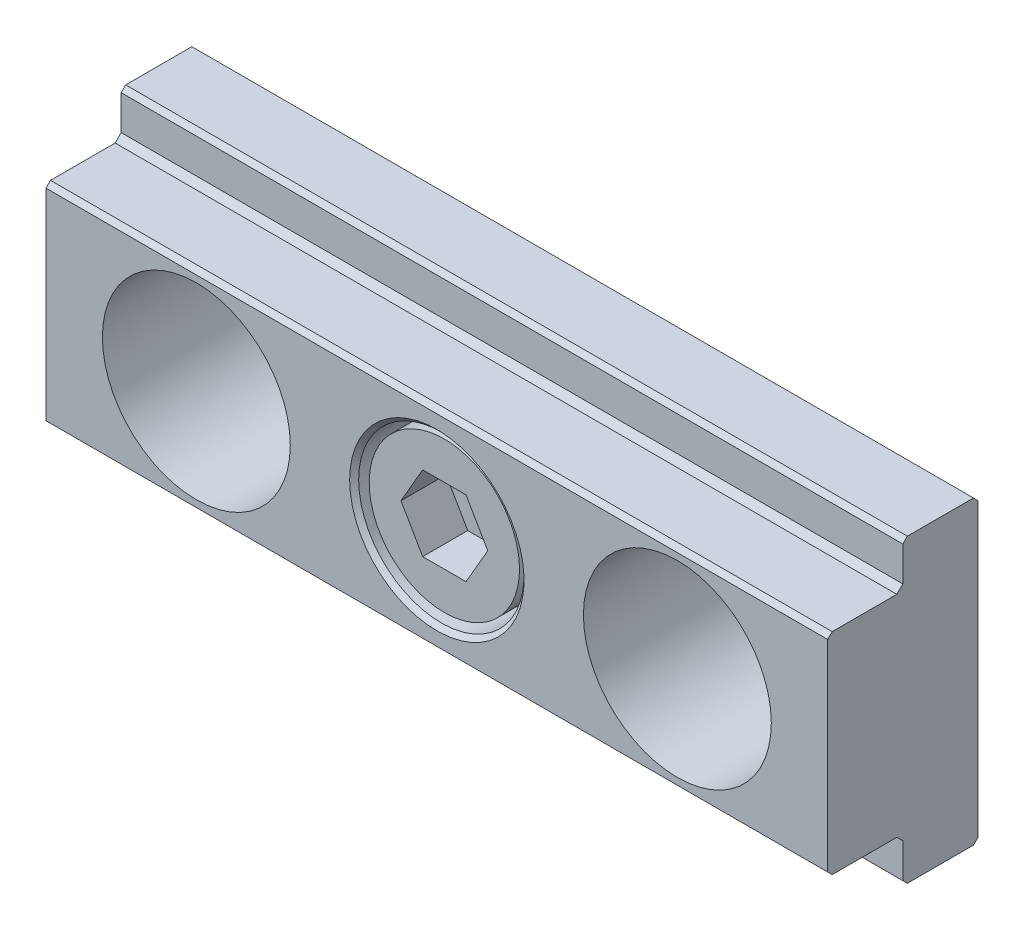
ISO-10303-21;
HEADER;
FILE_DESCRIPTION(('STEP AP214'),'2;1');
FILE_NAME('part.step','',(''),(''),'','','');
FILE_SCHEMA(('AUTOMOTIVE_DESIGN { 1 0 10303 214 1 1 1 1 }'));
ENDSEC;
DATA;
#1=APPLICATION_CONTEXT('core data for automotive mechanical design processes');
#2=APPLICATION_PROTOCOL_DEFINITION('international standard','automotive_design',2000,#1);
#3=PRODUCT_CONTEXT('',#1,'mechanical');
#4=PRODUCT('Part','Part','',(#3));
#5=PRODUCT_RELATED_PRODUCT_CATEGORY('part','',(#4));
#6=PRODUCT_DEFINITION_FORMATION('','',#4);
#7=PRODUCT_DEFINITION_CONTEXT('part definition',#1,'design');
#8=PRODUCT_DEFINITION('design','',#6,#7);
#9=PRODUCT_DEFINITION_SHAPE('','',#8);
#10=(LENGTH_UNIT() NAMED_UNIT(*) SI_UNIT(.MILLI.,.METRE.));
#11=(NAMED_UNIT(*) PLANE_ANGLE_UNIT() SI_UNIT($,.RADIAN.));
#12=(NAMED_UNIT(*) SI_UNIT($,.STERADIAN.) SOLID_ANGLE_UNIT());
#13=UNCERTAINTY_MEASURE_WITH_UNIT(LENGTH_MEASURE(1.E-05),#10,'distance_accuracy_value','');
#14=(GEOMETRIC_REPRESENTATION_CONTEXT(3) GLOBAL_UNCERTAINTY_ASSIGNED_CONTEXT((#13)) GLOBAL_UNIT_ASSIGNED_CONTEXT((#10,
#11,#12)) REPRESENTATION_CONTEXT('',''));
#15=CARTESIAN_POINT('',(0.,0.,0.));
#16=DIRECTION('',(0.,0.,1.));
#17=DIRECTION('',(1.,0.,0.));
#18=AXIS2_PLACEMENT_3D('',#15,#16,#17);
#19=CARTESIAN_POINT('',(0.,-5.5,3.5));
#20=DIRECTION('',(0.,0.,-1.));
#21=DIRECTION('',(1.,0.,0.));
#22=AXIS2_PLACEMENT_3D('',#19,#20,#21);
#23=PLANE('',#22);
#24=CARTESIAN_POINT('',(0.,0.,3.5));
#25=DIRECTION('',(0.,0.,1.));
#26=DIRECTION('',(-1.,0.,0.));
#27=AXIS2_PLACEMENT_3D('',#24,#25,#26);
#28=CIRCLE('',#27,5.5);
#29=CARTESIAN_POINT('',(-5.5,0.,3.5));
#30=VERTEX_POINT('',#29);
#31=EDGE_CURVE('E207',#30,#30,#28,.T.);
#32=ORIENTED_EDGE('',*,*,#31,.T.);
#33=EDGE_LOOP('',(#32));
#34=FACE_BOUND('',#33,.T.);
#35=CARTESIAN_POINT('',(0.,0.,3.5));
#36=DIRECTION('',(0.,0.,1.));
#37=DIRECTION('',(0.,-1.,0.));
#38=AXIS2_PLACEMENT_3D('',#35,#36,#37);
#39=CIRCLE('',#38,5.);
#40=CARTESIAN_POINT('',(0.,-5.,3.5));
#41=VERTEX_POINT('',#40);
#42=EDGE_CURVE('E9',#41,#41,#39,.T.);
#43=ORIENTED_EDGE('',*,*,#42,.F.);
#44=EDGE_LOOP('',(#43));
#45=FACE_BOUND('',#44,.T.);
#46=ADVANCED_FACE('F14',(#34,#45),#23,.F.);
#47=CARTESIAN_POINT('',(-26.,-6.7,10.));
#48=DIRECTION('',(0.,0.70710678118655,-0.707106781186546));
#49=DIRECTION('',(0.,-0.707106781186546,-0.70710678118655));
#50=AXIS2_PLACEMENT_3D('',#47,#48,#49);
#51=PLANE('',#50);
#52=DIRECTION('',(0.,0.707106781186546,0.70710678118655));
#53=VECTOR('',#52,1.);
#54=CARTESIAN_POINT('',(26.,-6.7,10.));
#55=LINE('',#54,#53);
#56=CARTESIAN_POINT('',(26.,-7.,9.7));
#57=VERTEX_POINT('',#56);
#58=CARTESIAN_POINT('',(26.,-6.7,10.));
#59=VERTEX_POINT('',#58);
#60=EDGE_CURVE('E219',#57,#59,#55,.T.);
#61=ORIENTED_EDGE('',*,*,#60,.T.);
#62=DIRECTION('',(1.,0.,0.));
#63=VECTOR('',#62,1.);
#64=CARTESIAN_POINT('',(-26.,-6.7,10.));
#65=LINE('',#64,#63);
#66=CARTESIAN_POINT('',(-26.,-6.7,10.));
#67=VERTEX_POINT('',#66);
#68=EDGE_CURVE('E24',#67,#59,#65,.T.);
#69=ORIENTED_EDGE('',*,*,#68,.F.);
#70=DIRECTION('',(0.,0.707106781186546,0.70710678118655));
#71=VECTOR('',#70,1.);
#72=CARTESIAN_POINT('',(-26.,-6.7,10.));
#73=LINE('',#72,#71);
#74=CARTESIAN_POINT('',(-26.,-7.,9.7));
#75=VERTEX_POINT('',#74);
#76=EDGE_CURVE('E220',#75,#67,#73,.T.);
#77=ORIENTED_EDGE('',*,*,#76,.F.);
#78=DIRECTION('',(1.,0.,0.));
#79=VECTOR('',#78,1.);
#80=CARTESIAN_POINT('',(-26.,-7.,9.7));
#81=LINE('',#80,#79);
#82=EDGE_CURVE('E265',#75,#57,#81,.T.);
#83=ORIENTED_EDGE('',*,*,#82,.T.);
#84=EDGE_LOOP('',(#61,#69,#77,#83));
#85=FACE_BOUND('',#84,.T.);
#86=ADVANCED_FACE('F351',(#85),#51,.F.);
#87=CARTESIAN_POINT('',(-26.,6.7,10.));
#88=DIRECTION('',(0.,0.,-1.));
#89=DIRECTION('',(1.,0.,0.));
#90=AXIS2_PLACEMENT_3D('',#87,#88,#89);
#91=PLANE('',#90);
#92=CARTESIAN_POINT('',(16.,0.,10.));
#93=DIRECTION('',(0.,0.,-1.));
#94=DIRECTION('',(-1.,0.,0.));
#95=AXIS2_PLACEMENT_3D('',#92,#93,#94);
#96=CIRCLE('',#95,6.25);
#97=CARTESIAN_POINT('',(9.75,0.,10.));
#98=VERTEX_POINT('',#97);
#99=EDGE_CURVE('E749',#98,#98,#96,.T.);
#100=ORIENTED_EDGE('',*,*,#99,.T.);
#101=EDGE_LOOP('',(#100));
#102=FACE_BOUND('',#101,.T.);
#103=CARTESIAN_POINT('',(-16.,0.,10.));
#104=DIRECTION('',(0.,0.,1.));
#105=DIRECTION('',(-1.,0.,0.));
#106=AXIS2_PLACEMENT_3D('',#103,#104,#105);
#107=CIRCLE('',#106,6.25);
#108=CARTESIAN_POINT('',(-22.25,0.,10.));
#109=VERTEX_POINT('',#108);
#110=EDGE_CURVE('E189',#109,#109,#107,.T.);
#111=ORIENTED_EDGE('',*,*,#110,.F.);
#112=EDGE_LOOP('',(#111));
#113=FACE_BOUND('',#112,.T.);
#114=CARTESIAN_POINT('',(0.,0.,10.));
#115=DIRECTION('',(0.,0.,1.));
#116=DIRECTION('',(-1.,0.,0.));
#117=AXIS2_PLACEMENT_3D('',#114,#115,#116);
#118=CIRCLE('',#117,5.8);
#119=CARTESIAN_POINT('',(-5.8,0.,10.));
#120=VERTEX_POINT('',#119);
#121=EDGE_CURVE('E198',#120,#120,#118,.T.);
#122=ORIENTED_EDGE('',*,*,#121,.F.);
#123=EDGE_LOOP('',(#122));
#124=FACE_BOUND('',#123,.T.);
#125=DIRECTION('',(0.,1.,0.));
#126=VECTOR('',#125,1.);
#127=CARTESIAN_POINT('',(26.,6.7,10.));
#128=LINE('',#127,#126);
#129=CARTESIAN_POINT('',(26.,6.7,10.));
#130=VERTEX_POINT('',#129);
#131=EDGE_CURVE('E268',#59,#130,#128,.T.);
#132=ORIENTED_EDGE('',*,*,#131,.T.);
#133=DIRECTION('',(1.,0.,0.));
#134=VECTOR('',#133,1.);
#135=CARTESIAN_POINT('',(-26.,6.7,10.));
#136=LINE('',#135,#134);
#137=CARTESIAN_POINT('',(-26.,6.7,10.));
#138=VERTEX_POINT('',#137);
#139=EDGE_CURVE('E337',#138,#130,#136,.T.);
#140=ORIENTED_EDGE('',*,*,#139,.F.);
#141=DIRECTION('',(0.,1.,0.));
#142=VECTOR('',#141,1.);
#143=CARTESIAN_POINT('',(-26.,6.7,10.));
#144=LINE('',#143,#142);
#145=EDGE_CURVE('E222',#67,#138,#144,.T.);
#146=ORIENTED_EDGE('',*,*,#145,.F.);
#147=ORIENTED_EDGE('',*,*,#68,.T.);
#148=EDGE_LOOP('',(#132,#140,#146,#147));
#149=FACE_BOUND('',#148,.T.);
#150=ADVANCED_FACE('F347',(#102,#113,#124,#149),#91,.F.);
#151=CARTESIAN_POINT('',(-26.,7.,9.7));
#152=DIRECTION('',(0.,-0.70710678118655,-0.707106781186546));
#153=DIRECTION('',(0.,-0.707106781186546,0.70710678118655));
#154=AXIS2_PLACEMENT_3D('',#151,#152,#153);
#155=PLANE('',#154);
#156=DIRECTION('',(0.,0.707106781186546,-0.70710678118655));
#157=VECTOR('',#156,1.);
#158=CARTESIAN_POINT('',(26.,7.,9.7));
#159=LINE('',#158,#157);
#160=CARTESIAN_POINT('',(26.,7.,9.7));
#161=VERTEX_POINT('',#160);
#162=EDGE_CURVE('E270',#130,#161,#159,.T.);
#163=ORIENTED_EDGE('',*,*,#162,.T.);
#164=DIRECTION('',(1.,0.,0.));
#165=VECTOR('',#164,1.);
#166=CARTESIAN_POINT('',(-26.,7.,9.7));
#167=LINE('',#166,#165);
#168=CARTESIAN_POINT('',(-26.,7.,9.7));
#169=VERTEX_POINT('',#168);
#170=EDGE_CURVE('E335',#169,#161,#167,.T.);
#171=ORIENTED_EDGE('',*,*,#170,.F.);
#172=DIRECTION('',(0.,0.707106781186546,-0.70710678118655));
#173=VECTOR('',#172,1.);
#174=CARTESIAN_POINT('',(-26.,7.,9.7));
#175=LINE('',#174,#173);
#176=EDGE_CURVE('E226',#138,#169,#175,.T.);
#177=ORIENTED_EDGE('',*,*,#176,.F.);
#178=ORIENTED_EDGE('',*,*,#139,.T.);
#179=EDGE_LOOP('',(#163,#171,#177,#178));
#180=FACE_BOUND('',#179,.T.);
#181=ADVANCED_FACE('F359',(#180),#155,.F.);
#182=CARTESIAN_POINT('',(-26.,7.,5.4));
#183=DIRECTION('',(0.,-1.,0.));
#184=DIRECTION('',(1.,0.,0.));
#185=AXIS2_PLACEMENT_3D('',#182,#183,#184);
#186=PLANE('',#185);
#187=DIRECTION('',(0.,0.,-1.));
#188=VECTOR('',#187,1.);
#189=CARTESIAN_POINT('',(26.,7.,5.4));
#190=LINE('',#189,#188);
#191=CARTESIAN_POINT('',(26.,7.,5.4));
#192=VERTEX_POINT('',#191);
#193=EDGE_CURVE('E272',#161,#192,#190,.T.);
#194=ORIENTED_EDGE('',*,*,#193,.T.);
#195=DIRECTION('',(1.,0.,0.));
#196=VECTOR('',#195,1.);
#197=CARTESIAN_POINT('',(-26.,7.,5.4));
#198=LINE('',#197,#196);
#199=CARTESIAN_POINT('',(-26.,7.,5.4));
#200=VERTEX_POINT('',#199);
#201=EDGE_CURVE('E332',#200,#192,#198,.T.);
#202=ORIENTED_EDGE('',*,*,#201,.F.);
#203=DIRECTION('',(0.,0.,-1.));
#204=VECTOR('',#203,1.);
#205=CARTESIAN_POINT('',(-26.,7.,5.4));
#206=LINE('',#205,#204);
#207=EDGE_CURVE('E229',#169,#200,#206,.T.);
#208=ORIENTED_EDGE('',*,*,#207,.F.);
#209=ORIENTED_EDGE('',*,*,#170,.T.);
#210=EDGE_LOOP('',(#194,#202,#208,#209));
#211=FACE_BOUND('',#210,.T.);
#212=ADVANCED_FACE('F363',(#211),#186,.F.);
#213=CARTESIAN_POINT('',(-26.,7.4,5.));
#214=DIRECTION('',(0.,-0.707106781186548,-0.707106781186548));
#215=DIRECTION('',(0.,-0.707106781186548,0.707106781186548));
#216=AXIS2_PLACEMENT_3D('',#213,#214,#215);
#217=PLANE('',#216);
#218=DIRECTION('',(0.,0.707106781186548,-0.707106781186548));
#219=VECTOR('',#218,1.);
#220=CARTESIAN_POINT('',(26.,7.4,5.));
#221=LINE('',#220,#219);
#222=CARTESIAN_POINT('',(26.,7.4,5.));
#223=VERTEX_POINT('',#222);
#224=EDGE_CURVE('E274',#192,#223,#221,.T.);
#225=ORIENTED_EDGE('',*,*,#224,.T.);
#226=DIRECTION('',(1.,0.,0.));
#227=VECTOR('',#226,1.);
#228=CARTESIAN_POINT('',(-26.,7.4,5.));
#229=LINE('',#228,#227);
#230=CARTESIAN_POINT('',(-26.,7.4,5.));
#231=VERTEX_POINT('',#230);
#232=EDGE_CURVE('E329',#231,#223,#229,.T.);
#233=ORIENTED_EDGE('',*,*,#232,.F.);
#234=DIRECTION('',(0.,0.707106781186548,-0.707106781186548));
#235=VECTOR('',#234,1.);
#236=CARTESIAN_POINT('',(-26.,7.4,5.));
#237=LINE('',#236,#235);
#238=EDGE_CURVE('E232',#200,#231,#237,.T.);
#239=ORIENTED_EDGE('',*,*,#238,.F.);
#240=ORIENTED_EDGE('',*,*,#201,.T.);
#241=EDGE_LOOP('',(#225,#233,#239,#240));
#242=FACE_BOUND('',#241,.T.);
#243=ADVANCED_FACE('F671',(#242),#217,.F.);
#244=CARTESIAN_POINT('',(-26.,9.7,5.));
#245=DIRECTION('',(0.,0.,-1.));
#246=DIRECTION('',(1.,0.,0.));
#247=AXIS2_PLACEMENT_3D('',#244,#245,#246);
#248=PLANE('',#247);
#249=DIRECTION('',(0.,1.,0.));
#250=VECTOR('',#249,1.);
#251=CARTESIAN_POINT('',(26.,9.7,5.));
#252=LINE('',#251,#250);
#253=CARTESIAN_POINT('',(26.,9.7,5.));
#254=VERTEX_POINT('',#253);
#255=EDGE_CURVE('E276',#223,#254,#252,.T.);
#256=ORIENTED_EDGE('',*,*,#255,.T.);
#257=DIRECTION('',(1.,0.,0.));
#258=VECTOR('',#257,1.);
#259=CARTESIAN_POINT('',(-26.,9.7,5.));
#260=LINE('',#259,#258);
#261=CARTESIAN_POINT('',(-26.,9.7,5.));
#262=VERTEX_POINT('',#261);
#263=EDGE_CURVE('E326',#262,#254,#260,.T.);
#264=ORIENTED_EDGE('',*,*,#263,.F.);
#265=DIRECTION('',(0.,1.,0.));
#266=VECTOR('',#265,1.);
#267=CARTESIAN_POINT('',(-26.,9.7,5.));
#268=LINE('',#267,#266);
#269=EDGE_CURVE('E235',#231,#262,#268,.T.);
#270=ORIENTED_EDGE('',*,*,#269,.F.);
#271=ORIENTED_EDGE('',*,*,#232,.T.);
#272=EDGE_LOOP('',(#256,#264,#270,#271));
#273=FACE_BOUND('',#272,.T.);
#274=ADVANCED_FACE('F662',(#273),#248,.F.);
#275=CARTESIAN_POINT('',(-26.,10.,4.7));
#276=DIRECTION('',(0.,-0.707106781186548,-0.707106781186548));
#277=DIRECTION('',(0.,-0.707106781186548,0.707106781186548));
#278=AXIS2_PLACEMENT_3D('',#275,#276,#277);
#279=PLANE('',#278);
#280=DIRECTION('',(0.,0.707106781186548,-0.707106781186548));
#281=VECTOR('',#280,1.);
#282=CARTESIAN_POINT('',(26.,10.,4.7));
#283=LINE('',#282,#281);
#284=CARTESIAN_POINT('',(26.,10.,4.7));
#285=VERTEX_POINT('',#284);
#286=EDGE_CURVE('E278',#254,#285,#283,.T.);
#287=ORIENTED_EDGE('',*,*,#286,.T.);
#288=DIRECTION('',(1.,0.,0.));
#289=VECTOR('',#288,1.);
#290=CARTESIAN_POINT('',(-26.,10.,4.7));
#291=LINE('',#290,#289);
#292=CARTESIAN_POINT('',(-26.,10.,4.7));
#293=VERTEX_POINT('',#292);
#294=EDGE_CURVE('E323',#293,#285,#291,.T.);
#295=ORIENTED_EDGE('',*,*,#294,.F.);
#296=DIRECTION('',(0.,0.707106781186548,-0.707106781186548));
#297=VECTOR('',#296,1.);
#298=CARTESIAN_POINT('',(-26.,10.,4.7));
#299=LINE('',#298,#297);
#300=EDGE_CURVE('E238',#262,#293,#299,.T.);
#301=ORIENTED_EDGE('',*,*,#300,.F.);
#302=ORIENTED_EDGE('',*,*,#263,.T.);
#303=EDGE_LOOP('',(#287,#295,#301,#302));
#304=FACE_BOUND('',#303,.T.);
#305=ADVANCED_FACE('F653',(#304),#279,.F.);
#306=CARTESIAN_POINT('',(-26.,10.,0.3));
#307=DIRECTION('',(0.,-1.,0.));
#308=DIRECTION('',(0.,0.,1.));
#309=AXIS2_PLACEMENT_3D('',#306,#307,#308);
#310=PLANE('',#309);
#311=DIRECTION('',(0.,0.,-1.));
#312=VECTOR('',#311,1.);
#313=CARTESIAN_POINT('',(26.,10.,0.3));
#314=LINE('',#313,#312);
#315=CARTESIAN_POINT('',(26.,10.,0.3));
#316=VERTEX_POINT('',#315);
#317=EDGE_CURVE('E280',#285,#316,#314,.T.);
#318=ORIENTED_EDGE('',*,*,#317,.T.);
#319=DIRECTION('',(1.,0.,0.));
#320=VECTOR('',#319,1.);
#321=CARTESIAN_POINT('',(-26.,10.,0.3));
#322=LINE('',#321,#320);
#323=CARTESIAN_POINT('',(-26.,10.,0.3));
#324=VERTEX_POINT('',#323);
#325=EDGE_CURVE('E320',#324,#316,#322,.T.);
#326=ORIENTED_EDGE('',*,*,#325,.F.);
#327=DIRECTION('',(0.,0.,-1.));
#328=VECTOR('',#327,1.);
#329=CARTESIAN_POINT('',(-26.,10.,0.3));
#330=LINE('',#329,#328);
#331=EDGE_CURVE('E241',#293,#324,#330,.T.);
#332=ORIENTED_EDGE('',*,*,#331,.F.);
#333=ORIENTED_EDGE('',*,*,#294,.T.);
#334=EDGE_LOOP('',(#318,#326,#332,#333));
#335=FACE_BOUND('',#334,.T.);
#336=ADVANCED_FACE('F644',(#335),#310,.F.);
#337=CARTESIAN_POINT('',(-26.,10.,0.3));
#338=DIRECTION('',(0.,-0.70710678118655,0.707106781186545));
#339=DIRECTION('',(0.,0.707106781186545,0.70710678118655));
#340=AXIS2_PLACEMENT_3D('',#337,#338,#339);
#341=PLANE('',#340);
#342=DIRECTION('',(0.,-0.707106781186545,-0.70710678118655));
#343=VECTOR('',#342,1.);
#344=CARTESIAN_POINT('',(26.,10.,0.3));
#345=LINE('',#344,#343);
#346=CARTESIAN_POINT('',(26.,9.7,0.));
#347=VERTEX_POINT('',#346);
#348=EDGE_CURVE('E282',#316,#347,#345,.T.);
#349=ORIENTED_EDGE('',*,*,#348,.T.);
#350=DIRECTION('',(1.,0.,0.));
#351=VECTOR('',#350,1.);
#352=CARTESIAN_POINT('',(-26.,9.7,0.));
#353=LINE('',#352,#351);
#354=CARTESIAN_POINT('',(-26.,9.7,0.));
#355=VERTEX_POINT('',#354);
#356=EDGE_CURVE('E317',#355,#347,#353,.T.);
#357=ORIENTED_EDGE('',*,*,#356,.F.);
#358=DIRECTION('',(0.,-0.707106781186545,-0.70710678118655));
#359=VECTOR('',#358,1.);
#360=CARTESIAN_POINT('',(-26.,10.,0.3));
#361=LINE('',#360,#359);
#362=EDGE_CURVE('E244',#324,#355,#361,.T.);
#363=ORIENTED_EDGE('',*,*,#362,.F.);
#364=ORIENTED_EDGE('',*,*,#325,.T.);
#365=EDGE_LOOP('',(#349,#357,#363,#364));
#366=FACE_BOUND('',#365,.T.);
#367=ADVANCED_FACE('F635',(#366),#341,.F.);
#368=CARTESIAN_POINT('',(-26.,9.7,0.));
#369=DIRECTION('',(0.,0.,1.));
#370=DIRECTION('',(-1.,0.,0.));
#371=AXIS2_PLACEMENT_3D('',#368,#369,#370);
#372=PLANE('',#371);
#373=CARTESIAN_POINT('',(16.,0.,0.));
#374=DIRECTION('',(0.,0.,1.));
#375=DIRECTION('',(0.,1.,0.));
#376=AXIS2_PLACEMENT_3D('',#373,#374,#375);
#377=CIRCLE('',#376,6.25);
#378=CARTESIAN_POINT('',(16.,6.24999999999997,0.));
#379=VERTEX_POINT('',#378);
#380=EDGE_CURVE('E18',#379,#379,#377,.T.);
#381=ORIENTED_EDGE('',*,*,#380,.T.);
#382=EDGE_LOOP('',(#381));
#383=FACE_BOUND('',#382,.T.);
#384=CARTESIAN_POINT('',(-16.,0.,0.));
#385=DIRECTION('',(0.,0.,1.));
#386=DIRECTION('',(-1.,0.,0.));
#387=AXIS2_PLACEMENT_3D('',#384,#385,#386);
#388=CIRCLE('',#387,6.25);
#389=CARTESIAN_POINT('',(-22.25,0.,0.));
#390=VERTEX_POINT('',#389);
#391=EDGE_CURVE('E193',#390,#390,#388,.T.);
#392=ORIENTED_EDGE('',*,*,#391,.T.);
#393=EDGE_LOOP('',(#392));
#394=FACE_BOUND('',#393,.T.);
#395=CARTESIAN_POINT('',(0.,0.,0.));
#396=DIRECTION('',(0.,0.,1.));
#397=DIRECTION('',(-1.,0.,0.));
#398=AXIS2_PLACEMENT_3D('',#395,#396,#397);
#399=CIRCLE('',#398,3.6);
#400=CARTESIAN_POINT('',(-3.6,0.,0.));
#401=VERTEX_POINT('',#400);
#402=EDGE_CURVE('E216',#401,#401,#399,.T.);
#403=ORIENTED_EDGE('',*,*,#402,.T.);
#404=EDGE_LOOP('',(#403));
#405=FACE_BOUND('',#404,.T.);
#406=DIRECTION('',(0.,-1.,0.));
#407=VECTOR('',#406,1.);
#408=CARTESIAN_POINT('',(26.,9.7,0.));
#409=LINE('',#408,#407);
#410=CARTESIAN_POINT('',(26.,-9.7,0.));
#411=VERTEX_POINT('',#410);
#412=EDGE_CURVE('E284',#347,#411,#409,.T.);
#413=ORIENTED_EDGE('',*,*,#412,.T.);
#414=DIRECTION('',(1.,0.,0.));
#415=VECTOR('',#414,1.);
#416=CARTESIAN_POINT('',(-26.,-9.7,0.));
#417=LINE('',#416,#415);
#418=CARTESIAN_POINT('',(-26.,-9.7,0.));
#419=VERTEX_POINT('',#418);
#420=EDGE_CURVE('E314',#419,#411,#417,.T.);
#421=ORIENTED_EDGE('',*,*,#420,.F.);
#422=DIRECTION('',(0.,-1.,0.));
#423=VECTOR('',#422,1.);
#424=CARTESIAN_POINT('',(-26.,9.7,0.));
#425=LINE('',#424,#423);
#426=EDGE_CURVE('E247',#355,#419,#425,.T.);
#427=ORIENTED_EDGE('',*,*,#426,.F.);
#428=ORIENTED_EDGE('',*,*,#356,.T.);
#429=EDGE_LOOP('',(#413,#421,#427,#428));
#430=FACE_BOUND('',#429,.T.);
#431=ADVANCED_FACE('F626',(#383,#394,#405,#430),#372,.F.);
#432=CARTESIAN_POINT('',(-26.,-9.7,0.));
#433=DIRECTION('',(0.,0.70710678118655,0.707106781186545));
#434=DIRECTION('',(0.,0.707106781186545,-0.70710678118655));
#435=AXIS2_PLACEMENT_3D('',#432,#433,#434);
#436=PLANE('',#435);
#437=DIRECTION('',(0.,-0.707106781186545,0.70710678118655));
#438=VECTOR('',#437,1.);
#439=CARTESIAN_POINT('',(26.,-9.7,0.));
#440=LINE('',#439,#438);
#441=CARTESIAN_POINT('',(26.,-10.,0.3));
#442=VERTEX_POINT('',#441);
#443=EDGE_CURVE('E286',#411,#442,#440,.T.);
#444=ORIENTED_EDGE('',*,*,#443,.T.);
#445=DIRECTION('',(1.,0.,0.));
#446=VECTOR('',#445,1.);
#447=CARTESIAN_POINT('',(-26.,-10.,0.3));
#448=LINE('',#447,#446);
#449=CARTESIAN_POINT('',(-26.,-10.,0.3));
#450=VERTEX_POINT('',#449);
#451=EDGE_CURVE('E311',#450,#442,#448,.T.);
#452=ORIENTED_EDGE('',*,*,#451,.F.);
#453=DIRECTION('',(0.,-0.707106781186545,0.70710678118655));
#454=VECTOR('',#453,1.);
#455=CARTESIAN_POINT('',(-26.,-9.7,0.));
#456=LINE('',#455,#454);
#457=EDGE_CURVE('E250',#419,#450,#456,.T.);
#458=ORIENTED_EDGE('',*,*,#457,.F.);
#459=ORIENTED_EDGE('',*,*,#420,.T.);
#460=EDGE_LOOP('',(#444,#452,#458,#459));
#461=FACE_BOUND('',#460,.T.);
#462=ADVANCED_FACE('F617',(#461),#436,.F.);
#463=CARTESIAN_POINT('',(-26.,-10.,0.3));
#464=DIRECTION('',(0.,1.,0.));
#465=DIRECTION('',(0.,0.,-1.));
#466=AXIS2_PLACEMENT_3D('',#463,#464,#465);
#467=PLANE('',#466);
#468=DIRECTION('',(0.,0.,1.));
#469=VECTOR('',#468,1.);
#470=CARTESIAN_POINT('',(26.,-10.,0.3));
#471=LINE('',#470,#469);
#472=CARTESIAN_POINT('',(26.,-10.,4.7));
#473=VERTEX_POINT('',#472);
#474=EDGE_CURVE('E288',#442,#473,#471,.T.);
#475=ORIENTED_EDGE('',*,*,#474,.T.);
#476=DIRECTION('',(1.,0.,0.));
#477=VECTOR('',#476,1.);
#478=CARTESIAN_POINT('',(-26.,-10.,4.7));
#479=LINE('',#478,#477);
#480=CARTESIAN_POINT('',(-26.,-10.,4.7));
#481=VERTEX_POINT('',#480);
#482=EDGE_CURVE('E308',#481,#473,#479,.T.);
#483=ORIENTED_EDGE('',*,*,#482,.F.);
#484=DIRECTION('',(0.,0.,1.));
#485=VECTOR('',#484,1.);
#486=CARTESIAN_POINT('',(-26.,-10.,0.3));
#487=LINE('',#486,#485);
#488=EDGE_CURVE('E253',#450,#481,#487,.T.);
#489=ORIENTED_EDGE('',*,*,#488,.F.);
#490=ORIENTED_EDGE('',*,*,#451,.T.);
#491=EDGE_LOOP('',(#475,#483,#489,#490));
#492=FACE_BOUND('',#491,.T.);
#493=ADVANCED_FACE('F608',(#492),#467,.F.);
#494=CARTESIAN_POINT('',(-26.,-9.7,5.));
#495=DIRECTION('',(0.,0.707106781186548,-0.707106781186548));
#496=DIRECTION('',(0.,-0.707106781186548,-0.707106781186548));
#497=AXIS2_PLACEMENT_3D('',#494,#495,#496);
#498=PLANE('',#497);
#499=DIRECTION('',(0.,0.707106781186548,0.707106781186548));
#500=VECTOR('',#499,1.);
#501=CARTESIAN_POINT('',(26.,-9.7,5.));
#502=LINE('',#501,#500);
#503=CARTESIAN_POINT('',(26.,-9.7,5.));
#504=VERTEX_POINT('',#503);
#505=EDGE_CURVE('E290',#473,#504,#502,.T.);
#506=ORIENTED_EDGE('',*,*,#505,.T.);
#507=DIRECTION('',(1.,0.,0.));
#508=VECTOR('',#507,1.);
#509=CARTESIAN_POINT('',(-26.,-9.7,5.));
#510=LINE('',#509,#508);
#511=CARTESIAN_POINT('',(-26.,-9.7,5.));
#512=VERTEX_POINT('',#511);
#513=EDGE_CURVE('E305',#512,#504,#510,.T.);
#514=ORIENTED_EDGE('',*,*,#513,.F.);
#515=DIRECTION('',(0.,0.707106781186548,0.707106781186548));
#516=VECTOR('',#515,1.);
#517=CARTESIAN_POINT('',(-26.,-9.7,5.));
#518=LINE('',#517,#516);
#519=EDGE_CURVE('E256',#481,#512,#518,.T.);
#520=ORIENTED_EDGE('',*,*,#519,.F.);
#521=ORIENTED_EDGE('',*,*,#482,.T.);
#522=EDGE_LOOP('',(#506,#514,#520,#521));
#523=FACE_BOUND('',#522,.T.);
#524=ADVANCED_FACE('F601',(#523),#498,.F.);
#525=CARTESIAN_POINT('',(-26.,-7.4,5.));
#526=DIRECTION('',(0.,0.,-1.));
#527=DIRECTION('',(1.,0.,0.));
#528=AXIS2_PLACEMENT_3D('',#525,#526,#527);
#529=PLANE('',#528);
#530=DIRECTION('',(0.,1.,0.));
#531=VECTOR('',#530,1.);
#532=CARTESIAN_POINT('',(26.,-7.4,5.));
#533=LINE('',#532,#531);
#534=CARTESIAN_POINT('',(26.,-7.4,5.));
#535=VERTEX_POINT('',#534);
#536=EDGE_CURVE('E292',#504,#535,#533,.T.);
#537=ORIENTED_EDGE('',*,*,#536,.T.);
#538=DIRECTION('',(1.,0.,0.));
#539=VECTOR('',#538,1.);
#540=CARTESIAN_POINT('',(-26.,-7.4,5.));
#541=LINE('',#540,#539);
#542=CARTESIAN_POINT('',(-26.,-7.4,5.));
#543=VERTEX_POINT('',#542);
#544=EDGE_CURVE('E302',#543,#535,#541,.T.);
#545=ORIENTED_EDGE('',*,*,#544,.F.);
#546=DIRECTION('',(0.,1.,0.));
#547=VECTOR('',#546,1.);
#548=CARTESIAN_POINT('',(-26.,-7.4,5.));
#549=LINE('',#548,#547);
#550=EDGE_CURVE('E259',#512,#543,#549,.T.);
#551=ORIENTED_EDGE('',*,*,#550,.F.);
#552=ORIENTED_EDGE('',*,*,#513,.T.);
#553=EDGE_LOOP('',(#537,#545,#551,#552));
#554=FACE_BOUND('',#553,.T.);
#555=ADVANCED_FACE('F398',(#554),#529,.F.);
#556=CARTESIAN_POINT('',(-26.,-7.4,5.));
#557=DIRECTION('',(0.,0.707106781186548,-0.707106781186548));
#558=DIRECTION('',(0.,-0.707106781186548,-0.707106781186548));
#559=AXIS2_PLACEMENT_3D('',#556,#557,#558);
#560=PLANE('',#559);
#561=DIRECTION('',(0.,0.707106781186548,0.707106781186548));
#562=VECTOR('',#561,1.);
#563=CARTESIAN_POINT('',(26.,-7.4,5.));
#564=LINE('',#563,#562);
#565=CARTESIAN_POINT('',(26.,-7.,5.4));
#566=VERTEX_POINT('',#565);
#567=EDGE_CURVE('E294',#535,#566,#564,.T.);
#568=ORIENTED_EDGE('',*,*,#567,.T.);
#569=DIRECTION('',(1.,0.,0.));
#570=VECTOR('',#569,1.);
#571=CARTESIAN_POINT('',(-26.,-7.,5.4));
#572=LINE('',#571,#570);
#573=CARTESIAN_POINT('',(-26.,-7.,5.4));
#574=VERTEX_POINT('',#573);
#575=EDGE_CURVE('E299',#574,#566,#572,.T.);
#576=ORIENTED_EDGE('',*,*,#575,.F.);
#577=DIRECTION('',(0.,0.707106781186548,0.707106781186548));
#578=VECTOR('',#577,1.);
#579=CARTESIAN_POINT('',(-26.,-7.4,5.));
#580=LINE('',#579,#578);
#581=EDGE_CURVE('E262',#543,#574,#580,.T.);
#582=ORIENTED_EDGE('',*,*,#581,.F.);
#583=ORIENTED_EDGE('',*,*,#544,.T.);
#584=EDGE_LOOP('',(#568,#576,#582,#583));
#585=FACE_BOUND('',#584,.T.);
#586=ADVANCED_FACE('F401',(#585),#560,.F.);
#587=CARTESIAN_POINT('',(-26.,-7.,5.4));
#588=DIRECTION('',(0.,1.,0.));
#589=DIRECTION('',(-1.,0.,0.));
#590=AXIS2_PLACEMENT_3D('',#587,#588,#589);
#591=PLANE('',#590);
#592=DIRECTION('',(0.,0.,1.));
#593=VECTOR('',#592,1.);
#594=CARTESIAN_POINT('',(26.,-7.,5.4));
#595=LINE('',#594,#593);
#596=EDGE_CURVE('E223',#566,#57,#595,.T.);
#597=ORIENTED_EDGE('',*,*,#596,.T.);
#598=ORIENTED_EDGE('',*,*,#82,.F.);
#599=DIRECTION('',(0.,0.,1.));
#600=VECTOR('',#599,1.);
#601=CARTESIAN_POINT('',(-26.,-7.,5.4));
#602=LINE('',#601,#600);
#603=EDGE_CURVE('E33',#574,#75,#602,.T.);
#604=ORIENTED_EDGE('',*,*,#603,.F.);
#605=ORIENTED_EDGE('',*,*,#575,.T.);
#606=EDGE_LOOP('',(#597,#598,#604,#605));
#607=FACE_BOUND('',#606,.T.);
#608=ADVANCED_FACE('F403',(#607),#591,.F.);
#609=CARTESIAN_POINT('',(-26.,-13.2,3.5));
#610=DIRECTION('',(-1.,0.,0.));
#611=DIRECTION('',(0.,-1.,0.));
#612=AXIS2_PLACEMENT_3D('',#609,#610,#611);
#613=PLANE('',#612);
#614=ORIENTED_EDGE('',*,*,#76,.T.);
#615=ORIENTED_EDGE('',*,*,#145,.T.);
#616=ORIENTED_EDGE('',*,*,#176,.T.);
#617=ORIENTED_EDGE('',*,*,#207,.T.);
#618=ORIENTED_EDGE('',*,*,#238,.T.);
#619=ORIENTED_EDGE('',*,*,#269,.T.);
#620=ORIENTED_EDGE('',*,*,#300,.T.);
#621=ORIENTED_EDGE('',*,*,#331,.T.);
#622=ORIENTED_EDGE('',*,*,#362,.T.);
#623=ORIENTED_EDGE('',*,*,#426,.T.);
#624=ORIENTED_EDGE('',*,*,#457,.T.);
#625=ORIENTED_EDGE('',*,*,#488,.T.);
#626=ORIENTED_EDGE('',*,*,#519,.T.);
#627=ORIENTED_EDGE('',*,*,#550,.T.);
#628=ORIENTED_EDGE('',*,*,#581,.T.);
#629=ORIENTED_EDGE('',*,*,#603,.T.);
#630=EDGE_LOOP('',(#614,#615,#616,#617,#618,#619,#620,#621,#622,#623,#624,#625,#626,#627,#628,#629));
#631=FACE_BOUND('',#630,.T.);
#632=ADVANCED_FACE('F369',(#631),#613,.T.);
#633=CARTESIAN_POINT('',(26.,-13.2,3.5));
#634=DIRECTION('',(-1.,0.,0.));
#635=DIRECTION('',(0.,-1.,0.));
#636=AXIS2_PLACEMENT_3D('',#633,#634,#635);
#637=PLANE('',#636);
#638=ORIENTED_EDGE('',*,*,#60,.F.);
#639=ORIENTED_EDGE('',*,*,#596,.F.);
#640=ORIENTED_EDGE('',*,*,#567,.F.);
#641=ORIENTED_EDGE('',*,*,#536,.F.);
#642=ORIENTED_EDGE('',*,*,#505,.F.);
#643=ORIENTED_EDGE('',*,*,#474,.F.);
#644=ORIENTED_EDGE('',*,*,#443,.F.);
#645=ORIENTED_EDGE('',*,*,#412,.F.);
#646=ORIENTED_EDGE('',*,*,#348,.F.);
#647=ORIENTED_EDGE('',*,*,#317,.F.);
#648=ORIENTED_EDGE('',*,*,#286,.F.);
#649=ORIENTED_EDGE('',*,*,#255,.F.);
#650=ORIENTED_EDGE('',*,*,#224,.F.);
#651=ORIENTED_EDGE('',*,*,#193,.F.);
#652=ORIENTED_EDGE('',*,*,#162,.F.);
#653=ORIENTED_EDGE('',*,*,#131,.F.);
#654=EDGE_LOOP('',(#638,#639,#640,#641,#642,#643,#644,#645,#646,#647,#648,#649,#650,#651,#652,#653));
#655=FACE_BOUND('',#654,.T.);
#656=ADVANCED_FACE('F354',(#655),#637,.F.);
#657=CARTESIAN_POINT('',(0.,0.,0.3));
#658=DIRECTION('',(0.,0.,-1.));
#659=DIRECTION('',(1.,0.,0.));
#660=AXIS2_PLACEMENT_3D('',#657,#658,#659);
#661=CONICAL_SURFACE('',#660,3.3,0.78539816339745);
#662=ORIENTED_EDGE('',*,*,#402,.F.);
#663=EDGE_LOOP('',(#662));
#664=FACE_BOUND('',#663,.T.);
#665=CARTESIAN_POINT('',(0.,0.,0.3));
#666=DIRECTION('',(0.,0.,1.));
#667=DIRECTION('',(-1.,0.,0.));
#668=AXIS2_PLACEMENT_3D('',#665,#666,#667);
#669=CIRCLE('',#668,3.3);
#670=CARTESIAN_POINT('',(-3.3,0.,0.3));
#671=VERTEX_POINT('',#670);
#672=EDGE_CURVE('E213',#671,#671,#669,.T.);
#673=ORIENTED_EDGE('',*,*,#672,.T.);
#674=EDGE_LOOP('',(#673));
#675=FACE_BOUND('',#674,.T.);
#676=ADVANCED_FACE('F479',(#664,#675),#661,.F.);
#677=CARTESIAN_POINT('',(0.,0.,10.));
#678=DIRECTION('',(0.,0.,1.));
#679=DIRECTION('',(-1.,0.,0.));
#680=AXIS2_PLACEMENT_3D('',#677,#678,#679);
#681=CYLINDRICAL_SURFACE('',#680,3.3);
#682=ORIENTED_EDGE('',*,*,#672,.F.);
#683=EDGE_LOOP('',(#682));
#684=FACE_BOUND('',#683,.T.);
#685=CARTESIAN_POINT('',(0.,0.,3.5));
#686=DIRECTION('',(0.,0.,1.));
#687=DIRECTION('',(-1.,0.,0.));
#688=AXIS2_PLACEMENT_3D('',#685,#686,#687);
#689=CIRCLE('',#688,3.3);
#690=CARTESIAN_POINT('',(-3.3,0.,3.5));
#691=VERTEX_POINT('',#690);
#692=EDGE_CURVE('E210',#691,#691,#689,.T.);
#693=ORIENTED_EDGE('',*,*,#692,.T.);
#694=EDGE_LOOP('',(#693));
#695=FACE_BOUND('',#694,.T.);
#696=ADVANCED_FACE('F476',(#684,#695),#681,.F.);
#697=CARTESIAN_POINT('',(0.,0.,10.));
#698=DIRECTION('',(0.,0.,1.));
#699=DIRECTION('',(-1.,0.,0.));
#700=AXIS2_PLACEMENT_3D('',#697,#698,#699);
#701=CYLINDRICAL_SURFACE('',#700,5.5);
#702=ORIENTED_EDGE('',*,*,#31,.F.);
#703=EDGE_LOOP('',(#702));
#704=FACE_BOUND('',#703,.T.);
#705=CARTESIAN_POINT('',(0.,0.,9.7));
#706=DIRECTION('',(0.,0.,1.));
#707=DIRECTION('',(-1.,0.,0.));
#708=AXIS2_PLACEMENT_3D('',#705,#706,#707);
#709=CIRCLE('',#708,5.5);
#710=CARTESIAN_POINT('',(-5.5,0.,9.7));
#711=VERTEX_POINT('',#710);
#712=EDGE_CURVE('E204',#711,#711,#709,.T.);
#713=ORIENTED_EDGE('',*,*,#712,.T.);
#714=EDGE_LOOP('',(#713));
#715=FACE_BOUND('',#714,.T.);
#716=ADVANCED_FACE('F474',(#704,#715),#701,.F.);
#717=CARTESIAN_POINT('',(0.,0.,10.));
#718=DIRECTION('',(0.,0.,1.));
#719=DIRECTION('',(-1.,0.,0.));
#720=AXIS2_PLACEMENT_3D('',#717,#718,#719);
#721=CONICAL_SURFACE('',#720,5.8,0.785398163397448);
#722=ORIENTED_EDGE('',*,*,#712,.F.);
#723=EDGE_LOOP('',(#722));
#724=FACE_BOUND('',#723,.T.);
#725=ORIENTED_EDGE('',*,*,#121,.T.);
#726=EDGE_LOOP('',(#725));
#727=FACE_BOUND('',#726,.T.);
#728=ADVANCED_FACE('F511',(#724,#727),#721,.F.);
#729=CARTESIAN_POINT('',(-16.,0.,0.));
#730=DIRECTION('',(0.,0.,1.));
#731=DIRECTION('',(-1.,0.,0.));
#732=AXIS2_PLACEMENT_3D('',#729,#730,#731);
#733=CYLINDRICAL_SURFACE('',#732,6.25);
#734=ORIENTED_EDGE('',*,*,#391,.F.);
#735=EDGE_LOOP('',(#734));
#736=FACE_BOUND('',#735,.T.);
#737=ORIENTED_EDGE('',*,*,#110,.T.);
#738=EDGE_LOOP('',(#737));
#739=FACE_BOUND('',#738,.T.);
#740=ADVANCED_FACE('F449',(#736,#739),#733,.F.);
#741=CARTESIAN_POINT('',(1.44337567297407,-2.5,6.5));
#742=DIRECTION('',(0.,0.,1.));
#743=DIRECTION('',(0.,-1.,0.));
#744=AXIS2_PLACEMENT_3D('',#741,#742,#743);
#745=PLANE('',#744);
#746=DIRECTION('',(-0.5,-0.86602540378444,0.));
#747=VECTOR('',#746,1.);
#748=CARTESIAN_POINT('',(2.88675134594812,0.,6.5));
#749=LINE('',#748,#747);
#750=CARTESIAN_POINT('',(2.88675134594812,0.,6.5));
#751=VERTEX_POINT('',#750);
#752=CARTESIAN_POINT('',(1.44337567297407,-2.5,6.5));
#753=VERTEX_POINT('',#752);
#754=EDGE_CURVE('E148',#751,#753,#749,.T.);
#755=ORIENTED_EDGE('',*,*,#754,.F.);
#756=DIRECTION('',(-0.5,0.86602540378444,0.));
#757=VECTOR('',#756,1.);
#758=CARTESIAN_POINT('',(2.88675134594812,0.,6.5));
#759=LINE('',#758,#757);
#760=CARTESIAN_POINT('',(1.44337567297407,2.5,6.5));
#761=VERTEX_POINT('',#760);
#762=EDGE_CURVE('E142',#751,#761,#759,.T.);
#763=ORIENTED_EDGE('',*,*,#762,.T.);
#764=DIRECTION('',(-1.,0.,0.));
#765=VECTOR('',#764,1.);
#766=CARTESIAN_POINT('',(1.44337567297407,2.5,6.5));
#767=LINE('',#766,#765);
#768=CARTESIAN_POINT('',(-1.44337567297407,2.5,6.5));
#769=VERTEX_POINT('',#768);
#770=EDGE_CURVE('E163',#761,#769,#767,.T.);
#771=ORIENTED_EDGE('',*,*,#770,.T.);
#772=DIRECTION('',(0.5,0.86602540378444,0.));
#773=VECTOR('',#772,1.);
#774=CARTESIAN_POINT('',(-2.88675134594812,0.,6.5));
#775=LINE('',#774,#773);
#776=CARTESIAN_POINT('',(-2.88675134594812,0.,6.5));
#777=VERTEX_POINT('',#776);
#778=EDGE_CURVE('E166',#777,#769,#775,.T.);
#779=ORIENTED_EDGE('',*,*,#778,.F.);
#780=DIRECTION('',(0.5,-0.86602540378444,0.));
#781=VECTOR('',#780,1.);
#782=CARTESIAN_POINT('',(-2.88675134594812,0.,6.5));
#783=LINE('',#782,#781);
#784=CARTESIAN_POINT('',(-1.44337567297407,-2.5,6.5));
#785=VERTEX_POINT('',#784);
#786=EDGE_CURVE('E169',#777,#785,#783,.T.);
#787=ORIENTED_EDGE('',*,*,#786,.T.);
#788=DIRECTION('',(1.,0.,0.));
#789=VECTOR('',#788,1.);
#790=CARTESIAN_POINT('',(-1.44337567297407,-2.5,6.5));
#791=LINE('',#790,#789);
#792=EDGE_CURVE('E150',#785,#753,#791,.T.);
#793=ORIENTED_EDGE('',*,*,#792,.T.);
#794=EDGE_LOOP('',(#755,#763,#771,#779,#787,#793));
#795=FACE_BOUND('',#794,.T.);
#796=ADVANCED_FACE('F425',(#795),#745,.T.);
#797=CARTESIAN_POINT('',(1.44337567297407,2.5,6.5));
#798=DIRECTION('',(0.,1.,0.));
#799=DIRECTION('',(-1.,0.,0.));
#800=AXIS2_PLACEMENT_3D('',#797,#798,#799);
#801=PLANE('',#800);
#802=DIRECTION('',(0.,0.,1.));
#803=VECTOR('',#802,1.);
#804=CARTESIAN_POINT('',(1.44337567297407,2.5,6.5));
#805=LINE('',#804,#803);
#806=CARTESIAN_POINT('',(1.44337567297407,2.5,9.5));
#807=VERTEX_POINT('',#806);
#808=EDGE_CURVE('E143',#761,#807,#805,.T.);
#809=ORIENTED_EDGE('',*,*,#808,.T.);
#810=DIRECTION('',(-1.,0.,0.));
#811=VECTOR('',#810,1.);
#812=CARTESIAN_POINT('',(1.44337567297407,2.5,9.5));
#813=LINE('',#812,#811);
#814=CARTESIAN_POINT('',(-1.44337567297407,2.5,9.5));
#815=VERTEX_POINT('',#814);
#816=EDGE_CURVE('E147',#807,#815,#813,.T.);
#817=ORIENTED_EDGE('',*,*,#816,.T.);
#818=DIRECTION('',(0.,0.,1.));
#819=VECTOR('',#818,1.);
#820=CARTESIAN_POINT('',(-1.44337567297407,2.5,6.5));
#821=LINE('',#820,#819);
#822=EDGE_CURVE('E175',#769,#815,#821,.T.);
#823=ORIENTED_EDGE('',*,*,#822,.F.);
#824=ORIENTED_EDGE('',*,*,#770,.F.);
#825=EDGE_LOOP('',(#809,#817,#823,#824));
#826=FACE_BOUND('',#825,.T.);
#827=ADVANCED_FACE('F432',(#826),#801,.F.);
#828=CARTESIAN_POINT('',(-2.88675134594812,0.,6.5));
#829=DIRECTION('',(0.86602540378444,-0.5,0.));
#830=DIRECTION('',(0.5,0.86602540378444,0.));
#831=AXIS2_PLACEMENT_3D('',#828,#829,#830);
#832=PLANE('',#831);
#833=ORIENTED_EDGE('',*,*,#822,.T.);
#834=DIRECTION('',(0.5,0.86602540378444,0.));
#835=VECTOR('',#834,1.);
#836=CARTESIAN_POINT('',(-2.88675134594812,0.,9.5));
#837=LINE('',#836,#835);
#838=CARTESIAN_POINT('',(-2.88675134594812,0.,9.5));
#839=VERTEX_POINT('',#838);
#840=EDGE_CURVE('E152',#839,#815,#837,.T.);
#841=ORIENTED_EDGE('',*,*,#840,.F.);
#842=DIRECTION('',(0.,0.,1.));
#843=VECTOR('',#842,1.);
#844=CARTESIAN_POINT('',(-2.88675134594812,0.,6.5));
#845=LINE('',#844,#843);
#846=EDGE_CURVE('E177',#777,#839,#845,.T.);
#847=ORIENTED_EDGE('',*,*,#846,.F.);
#848=ORIENTED_EDGE('',*,*,#778,.T.);
#849=EDGE_LOOP('',(#833,#841,#847,#848));
#850=FACE_BOUND('',#849,.T.);
#851=ADVANCED_FACE('F435',(#850),#832,.T.);
#852=CARTESIAN_POINT('',(-2.88675134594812,0.,6.5));
#853=DIRECTION('',(-0.86602540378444,-0.5,0.));
#854=DIRECTION('',(0.5,-0.86602540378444,0.));
#855=AXIS2_PLACEMENT_3D('',#852,#853,#854);
#856=PLANE('',#855);
#857=ORIENTED_EDGE('',*,*,#846,.T.);
#858=DIRECTION('',(0.5,-0.86602540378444,0.));
#859=VECTOR('',#858,1.);
#860=CARTESIAN_POINT('',(-2.88675134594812,0.,9.5));
#861=LINE('',#860,#859);
#862=CARTESIAN_POINT('',(-1.44337567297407,-2.5,9.5));
#863=VERTEX_POINT('',#862);
#864=EDGE_CURVE('E158',#839,#863,#861,.T.);
#865=ORIENTED_EDGE('',*,*,#864,.T.);
#866=DIRECTION('',(0.,0.,1.));
#867=VECTOR('',#866,1.);
#868=CARTESIAN_POINT('',(-1.44337567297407,-2.5,6.5));
#869=LINE('',#868,#867);
#870=EDGE_CURVE('E179',#785,#863,#869,.T.);
#871=ORIENTED_EDGE('',*,*,#870,.F.);
#872=ORIENTED_EDGE('',*,*,#786,.F.);
#873=EDGE_LOOP('',(#857,#865,#871,#872));
#874=FACE_BOUND('',#873,.T.);
#875=ADVANCED_FACE('F426',(#874),#856,.F.);
#876=CARTESIAN_POINT('',(-1.44337567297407,-2.5,6.5));
#877=DIRECTION('',(0.,-1.,0.));
#878=DIRECTION('',(1.,0.,0.));
#879=AXIS2_PLACEMENT_3D('',#876,#877,#878);
#880=PLANE('',#879);
#881=ORIENTED_EDGE('',*,*,#870,.T.);
#882=DIRECTION('',(1.,0.,0.));
#883=VECTOR('',#882,1.);
#884=CARTESIAN_POINT('',(-1.44337567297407,-2.5,9.5));
#885=LINE('',#884,#883);
#886=CARTESIAN_POINT('',(1.44337567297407,-2.5,9.5));
#887=VERTEX_POINT('',#886);
#888=EDGE_CURVE('E133',#863,#887,#885,.T.);
#889=ORIENTED_EDGE('',*,*,#888,.T.);
#890=DIRECTION('',(0.,0.,1.));
#891=VECTOR('',#890,1.);
#892=CARTESIAN_POINT('',(1.44337567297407,-2.5,6.5));
#893=LINE('',#892,#891);
#894=EDGE_CURVE('E128',#753,#887,#893,.T.);
#895=ORIENTED_EDGE('',*,*,#894,.F.);
#896=ORIENTED_EDGE('',*,*,#792,.F.);
#897=EDGE_LOOP('',(#881,#889,#895,#896));
#898=FACE_BOUND('',#897,.T.);
#899=ADVANCED_FACE('F417',(#898),#880,.F.);
#900=CARTESIAN_POINT('',(2.88675134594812,0.,6.5));
#901=DIRECTION('',(-0.86602540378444,0.5,0.));
#902=DIRECTION('',(-0.5,-0.86602540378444,0.));
#903=AXIS2_PLACEMENT_3D('',#900,#901,#902);
#904=PLANE('',#903);
#905=ORIENTED_EDGE('',*,*,#894,.T.);
#906=DIRECTION('',(-0.5,-0.86602540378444,0.));
#907=VECTOR('',#906,1.);
#908=CARTESIAN_POINT('',(2.88675134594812,0.,9.5));
#909=LINE('',#908,#907);
#910=CARTESIAN_POINT('',(2.88675134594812,0.,9.5));
#911=VERTEX_POINT('',#910);
#912=EDGE_CURVE('E126',#911,#887,#909,.T.);
#913=ORIENTED_EDGE('',*,*,#912,.F.);
#914=DIRECTION('',(0.,0.,1.));
#915=VECTOR('',#914,1.);
#916=CARTESIAN_POINT('',(2.88675134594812,0.,6.5));
#917=LINE('',#916,#915);
#918=EDGE_CURVE('E123',#751,#911,#917,.T.);
#919=ORIENTED_EDGE('',*,*,#918,.F.);
#920=ORIENTED_EDGE('',*,*,#754,.T.);
#921=EDGE_LOOP('',(#905,#913,#919,#920));
#922=FACE_BOUND('',#921,.T.);
#923=ADVANCED_FACE('F127',(#922),#904,.T.);
#924=CARTESIAN_POINT('',(2.88675134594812,0.,6.5));
#925=DIRECTION('',(0.86602540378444,0.5,0.));
#926=DIRECTION('',(-0.5,0.86602540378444,0.));
#927=AXIS2_PLACEMENT_3D('',#924,#925,#926);
#928=PLANE('',#927);
#929=ORIENTED_EDGE('',*,*,#762,.F.);
#930=ORIENTED_EDGE('',*,*,#918,.T.);
#931=DIRECTION('',(-0.5,0.86602540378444,0.));
#932=VECTOR('',#931,1.);
#933=CARTESIAN_POINT('',(2.88675134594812,0.,9.5));
#934=LINE('',#933,#932);
#935=EDGE_CURVE('E139',#911,#807,#934,.T.);
#936=ORIENTED_EDGE('',*,*,#935,.T.);
#937=ORIENTED_EDGE('',*,*,#808,.F.);
#938=EDGE_LOOP('',(#929,#930,#936,#937));
#939=FACE_BOUND('',#938,.T.);
#940=ADVANCED_FACE('F138',(#939),#928,.F.);
#941=CARTESIAN_POINT('',(0.,0.,9.5));
#942=DIRECTION('',(0.,0.,1.));
#943=DIRECTION('',(0.,-1.,0.));
#944=AXIS2_PLACEMENT_3D('',#941,#942,#943);
#945=PLANE('',#944);
#946=CARTESIAN_POINT('',(0.,0.,9.5));
#947=DIRECTION('',(0.,0.,1.));
#948=DIRECTION('',(0.,-1.,0.));
#949=AXIS2_PLACEMENT_3D('',#946,#947,#948);
#950=CIRCLE('',#949,5.);
#951=CARTESIAN_POINT('',(0.,-5.,9.5));
#952=VERTEX_POINT('',#951);
#953=EDGE_CURVE('E187',#952,#952,#950,.T.);
#954=ORIENTED_EDGE('',*,*,#953,.T.);
#955=EDGE_LOOP('',(#954));
#956=FACE_BOUND('',#955,.T.);
#957=ORIENTED_EDGE('',*,*,#935,.F.);
#958=ORIENTED_EDGE('',*,*,#912,.T.);
#959=ORIENTED_EDGE('',*,*,#888,.F.);
#960=ORIENTED_EDGE('',*,*,#864,.F.);
#961=ORIENTED_EDGE('',*,*,#840,.T.);
#962=ORIENTED_EDGE('',*,*,#816,.F.);
#963=EDGE_LOOP('',(#957,#958,#959,#960,#961,#962));
#964=FACE_BOUND('',#963,.T.);
#965=ADVANCED_FACE('F16',(#956,#964),#945,.T.);
#966=CARTESIAN_POINT('',(0.,0.,13.5));
#967=DIRECTION('',(0.,0.,1.));
#968=DIRECTION('',(0.,-1.,0.));
#969=AXIS2_PLACEMENT_3D('',#966,#967,#968);
#970=CYLINDRICAL_SURFACE('',#969,5.);
#971=ORIENTED_EDGE('',*,*,#42,.T.);
#972=EDGE_LOOP('',(#971));
#973=FACE_BOUND('',#972,.T.);
#974=ORIENTED_EDGE('',*,*,#953,.F.);
#975=EDGE_LOOP('',(#974));
#976=FACE_BOUND('',#975,.T.);
#977=ADVANCED_FACE('F447',(#973,#976),#970,.T.);
#978=CARTESIAN_POINT('',(0.,-3.,-6.5));
#979=DIRECTION('',(0.,0.,-1.));
#980=DIRECTION('',(0.,1.,0.));
#981=AXIS2_PLACEMENT_3D('',#978,#979,#980);
#982=PLANE('',#981);
#983=CARTESIAN_POINT('',(0.,0.,-6.5));
#984=DIRECTION('',(0.,0.,1.));
#985=DIRECTION('',(0.,-1.,0.));
#986=AXIS2_PLACEMENT_3D('',#983,#984,#985);
#987=CIRCLE('',#986,3.);
#988=CARTESIAN_POINT('',(0.,-3.,-6.5));
#989=VERTEX_POINT('',#988);
#990=EDGE_CURVE('E182',#989,#989,#987,.T.);
#991=ORIENTED_EDGE('',*,*,#990,.F.);
#992=EDGE_LOOP('',(#991));
#993=FACE_BOUND('',#992,.T.);
#994=ADVANCED_FACE('F443',(#993),#982,.T.);
#995=CARTESIAN_POINT('',(0.,0.,13.5));
#996=DIRECTION('',(0.,0.,1.));
#997=DIRECTION('',(0.,-1.,0.));
#998=AXIS2_PLACEMENT_3D('',#995,#996,#997);
#999=CYLINDRICAL_SURFACE('',#998,3.);
#1000=ORIENTED_EDGE('',*,*,#990,.T.);
#1001=EDGE_LOOP('',(#1000));
#1002=FACE_BOUND('',#1001,.T.);
#1003=CARTESIAN_POINT('',(0.,0.,3.5));
#1004=DIRECTION('',(0.,0.,1.));
#1005=DIRECTION('',(0.,-1.,0.));
#1006=AXIS2_PLACEMENT_3D('',#1003,#1004,#1005);
#1007=CIRCLE('',#1006,3.);
#1008=CARTESIAN_POINT('',(0.,-3.,3.5));
#1009=VERTEX_POINT('',#1008);
#1010=EDGE_CURVE('E185',#1009,#1009,#1007,.T.);
#1011=ORIENTED_EDGE('',*,*,#1010,.F.);
#1012=EDGE_LOOP('',(#1011));
#1013=FACE_BOUND('',#1012,.T.);
#1014=ADVANCED_FACE('F446',(#1002,#1013),#999,.T.);
#1015=CARTESIAN_POINT('',(0.,-5.,3.5));
#1016=DIRECTION('',(0.,0.,-1.));
#1017=DIRECTION('',(0.,1.,0.));
#1018=AXIS2_PLACEMENT_3D('',#1015,#1016,#1017);
#1019=PLANE('',#1018);
#1020=ORIENTED_EDGE('',*,*,#1010,.T.);
#1021=EDGE_LOOP('',(#1020));
#1022=FACE_BOUND('',#1021,.T.);
#1023=ORIENTED_EDGE('',*,*,#692,.F.);
#1024=EDGE_LOOP('',(#1023));
#1025=FACE_BOUND('',#1024,.T.);
#1026=ADVANCED_FACE('F452',(#1022,#1025),#1019,.T.);
#1027=CARTESIAN_POINT('',(16.,0.,10.));
#1028=DIRECTION('',(0.,0.,-1.));
#1029=DIRECTION('',(-1.,0.,0.));
#1030=AXIS2_PLACEMENT_3D('',#1027,#1028,#1029);
#1031=CYLINDRICAL_SURFACE('',#1030,6.25);
#1032=ORIENTED_EDGE('',*,*,#99,.F.);
#1033=EDGE_LOOP('',(#1032));
#1034=FACE_BOUND('',#1033,.T.);
#1035=ORIENTED_EDGE('',*,*,#380,.F.);
#1036=EDGE_LOOP('',(#1035));
#1037=FACE_BOUND('',#1036,.T.);
#1038=ADVANCED_FACE('F455',(#1034,#1037),#1031,.F.);
#1039=CLOSED_SHELL('',(#46,#86,#150,#181,#212,#243,#274,#305,#336,#367,#431,#462,#493,#524,#555,
#586,#608,#632,#656,#676,#696,#716,#728,#740,#796,#827,#851,#875,#899,#923,#940,#965,#977,#994,
#1014,#1026,#1038));
#1040=MANIFOLD_SOLID_BREP('B1',#1039);
#1041=ADVANCED_BREP_SHAPE_REPRESENTATION('',(#18,#1040),#14);
#1042=SHAPE_DEFINITION_REPRESENTATION(#9,#1041);
ENDSEC;
END-ISO-10303-21;
